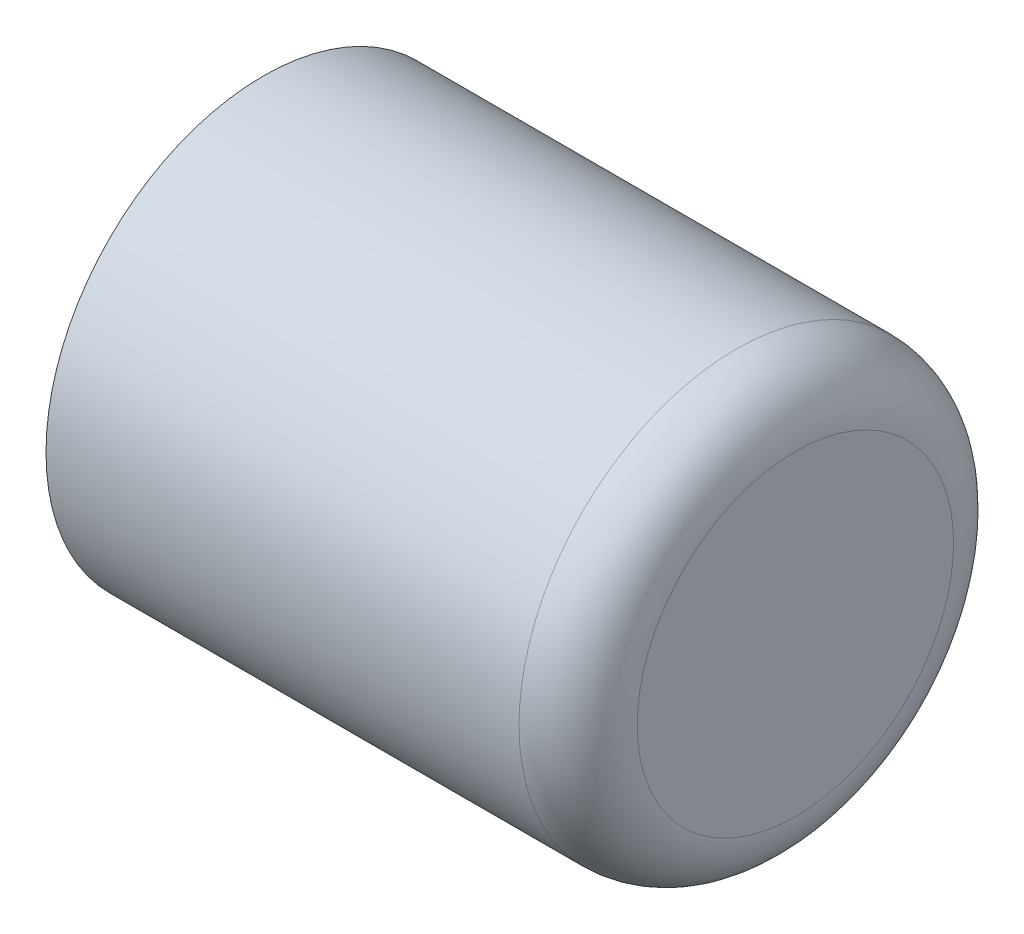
ISO-10303-21;
HEADER;
FILE_DESCRIPTION(('STEP AP214'),'2;1');
FILE_NAME('part.step','',(''),(''),'','','');
FILE_SCHEMA(('AUTOMOTIVE_DESIGN { 1 0 10303 214 1 1 1 1 }'));
ENDSEC;
DATA;
#1=APPLICATION_CONTEXT('core data for automotive mechanical design processes');
#2=APPLICATION_PROTOCOL_DEFINITION('international standard','automotive_design',2000,#1);
#3=PRODUCT_CONTEXT('',#1,'mechanical');
#4=PRODUCT('Part','Part','',(#3));
#5=PRODUCT_RELATED_PRODUCT_CATEGORY('part','',(#4));
#6=PRODUCT_DEFINITION_FORMATION('','',#4);
#7=PRODUCT_DEFINITION_CONTEXT('part definition',#1,'design');
#8=PRODUCT_DEFINITION('design','',#6,#7);
#9=PRODUCT_DEFINITION_SHAPE('','',#8);
#10=(LENGTH_UNIT() NAMED_UNIT(*) SI_UNIT(.MILLI.,.METRE.));
#11=(NAMED_UNIT(*) PLANE_ANGLE_UNIT() SI_UNIT($,.RADIAN.));
#12=(NAMED_UNIT(*) SI_UNIT($,.STERADIAN.) SOLID_ANGLE_UNIT());
#13=UNCERTAINTY_MEASURE_WITH_UNIT(LENGTH_MEASURE(1.E-05),#10,'distance_accuracy_value','');
#14=(GEOMETRIC_REPRESENTATION_CONTEXT(3) GLOBAL_UNCERTAINTY_ASSIGNED_CONTEXT((#13)) GLOBAL_UNIT_ASSIGNED_CONTEXT((#10,
#11,#12)) REPRESENTATION_CONTEXT('',''));
#15=CARTESIAN_POINT('',(0.,0.,0.));
#16=DIRECTION('',(0.,0.,1.));
#17=DIRECTION('',(1.,0.,0.));
#18=AXIS2_PLACEMENT_3D('',#15,#16,#17);
#19=CARTESIAN_POINT('',(0.,0.,0.));
#20=DIRECTION('',(-1.,0.,0.));
#21=DIRECTION('',(0.,0.,1.));
#22=AXIS2_PLACEMENT_3D('',#19,#20,#21);
#23=TOROIDAL_SURFACE('',#22,5.35,2.);
#24=CARTESIAN_POINT('',(0.,0.,0.));
#25=DIRECTION('',(-1.,0.,0.));
#26=DIRECTION('',(0.,0.,1.));
#27=AXIS2_PLACEMENT_3D('',#24,#25,#26);
#28=CIRCLE('',#27,7.35);
#29=CARTESIAN_POINT('',(0.,0.,7.35));
#30=VERTEX_POINT('',#29);
#31=EDGE_CURVE('E54',#30,#30,#28,.T.);
#32=ORIENTED_EDGE('',*,*,#31,.F.);
#33=EDGE_LOOP('',(#32));
#34=FACE_BOUND('',#33,.T.);
#35=CARTESIAN_POINT('',(2.,0.,0.));
#36=DIRECTION('',(-1.,0.,0.));
#37=DIRECTION('',(0.,0.,1.));
#38=AXIS2_PLACEMENT_3D('',#35,#36,#37);
#39=CIRCLE('',#38,5.35);
#40=CARTESIAN_POINT('',(2.,0.,5.35));
#41=VERTEX_POINT('',#40);
#42=EDGE_CURVE('E10',#41,#41,#39,.T.);
#43=ORIENTED_EDGE('',*,*,#42,.T.);
#44=EDGE_LOOP('',(#43));
#45=FACE_BOUND('',#44,.T.);
#46=ADVANCED_FACE('F32',(#34,#45),#23,.T.);
#47=CARTESIAN_POINT('',(2.,5.35,0.));
#48=DIRECTION('',(-1.,0.,0.));
#49=DIRECTION('',(0.,0.,1.));
#50=AXIS2_PLACEMENT_3D('',#47,#48,#49);
#51=PLANE('',#50);
#52=ORIENTED_EDGE('',*,*,#42,.F.);
#53=EDGE_LOOP('',(#52));
#54=FACE_BOUND('',#53,.T.);
#55=ADVANCED_FACE('F61',(#54),#51,.F.);
#56=CARTESIAN_POINT('',(0.799999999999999,5.35,0.));
#57=DIRECTION('',(1.,0.,0.));
#58=DIRECTION('',(0.,0.,-1.));
#59=AXIS2_PLACEMENT_3D('',#56,#57,#58);
#60=PLANE('',#59);
#61=CARTESIAN_POINT('',(0.799999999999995,0.,0.));
#62=DIRECTION('',(-1.,0.,0.));
#63=DIRECTION('',(0.,0.,1.));
#64=AXIS2_PLACEMENT_3D('',#61,#62,#63);
#65=CIRCLE('',#64,5.35);
#66=CARTESIAN_POINT('',(0.799999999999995,0.,5.35));
#67=VERTEX_POINT('',#66);
#68=EDGE_CURVE('E38',#67,#67,#65,.T.);
#69=ORIENTED_EDGE('',*,*,#68,.T.);
#70=EDGE_LOOP('',(#69));
#71=FACE_BOUND('',#70,.T.);
#72=ADVANCED_FACE('F65',(#71),#60,.F.);
#73=CARTESIAN_POINT('',(0.,0.,0.));
#74=DIRECTION('',(-1.,0.,0.));
#75=DIRECTION('',(0.,0.,1.));
#76=AXIS2_PLACEMENT_3D('',#73,#74,#75);
#77=TOROIDAL_SURFACE('',#76,5.35,0.799999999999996);
#78=ORIENTED_EDGE('',*,*,#68,.F.);
#79=EDGE_LOOP('',(#78));
#80=FACE_BOUND('',#79,.T.);
#81=CARTESIAN_POINT('',(0.,0.,0.));
#82=DIRECTION('',(-1.,0.,0.));
#83=DIRECTION('',(0.,0.,1.));
#84=AXIS2_PLACEMENT_3D('',#81,#82,#83);
#85=CIRCLE('',#84,6.15);
#86=CARTESIAN_POINT('',(0.,0.,6.15));
#87=VERTEX_POINT('',#86);
#88=EDGE_CURVE('E42',#87,#87,#85,.T.);
#89=ORIENTED_EDGE('',*,*,#88,.T.);
#90=EDGE_LOOP('',(#89));
#91=FACE_BOUND('',#90,.T.);
#92=ADVANCED_FACE('F70',(#80,#91),#77,.F.);
#93=CARTESIAN_POINT('',(-43.1825143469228,0.,0.));
#94=DIRECTION('',(-1.,0.,0.));
#95=DIRECTION('',(0.,0.,1.));
#96=AXIS2_PLACEMENT_3D('',#93,#94,#95);
#97=CYLINDRICAL_SURFACE('',#96,6.15);
#98=ORIENTED_EDGE('',*,*,#88,.F.);
#99=EDGE_LOOP('',(#98));
#100=FACE_BOUND('',#99,.T.);
#101=CARTESIAN_POINT('',(-16.,0.,0.));
#102=DIRECTION('',(-1.,0.,0.));
#103=DIRECTION('',(0.,0.,1.));
#104=AXIS2_PLACEMENT_3D('',#101,#102,#103);
#105=CIRCLE('',#104,6.15);
#106=CARTESIAN_POINT('',(-16.,0.,6.15));
#107=VERTEX_POINT('',#106);
#108=EDGE_CURVE('E46',#107,#107,#105,.T.);
#109=ORIENTED_EDGE('',*,*,#108,.T.);
#110=EDGE_LOOP('',(#109));
#111=FACE_BOUND('',#110,.T.);
#112=ADVANCED_FACE('F75',(#100,#111),#97,.F.);
#113=CARTESIAN_POINT('',(-16.,7.35,0.));
#114=DIRECTION('',(1.,0.,0.));
#115=DIRECTION('',(0.,0.,-1.));
#116=AXIS2_PLACEMENT_3D('',#113,#114,#115);
#117=PLANE('',#116);
#118=ORIENTED_EDGE('',*,*,#108,.F.);
#119=EDGE_LOOP('',(#118));
#120=FACE_BOUND('',#119,.T.);
#121=CARTESIAN_POINT('',(-16.,0.,0.));
#122=DIRECTION('',(-1.,0.,0.));
#123=DIRECTION('',(0.,0.,1.));
#124=AXIS2_PLACEMENT_3D('',#121,#122,#123);
#125=CIRCLE('',#124,7.35);
#126=CARTESIAN_POINT('',(-16.,0.,7.35));
#127=VERTEX_POINT('',#126);
#128=EDGE_CURVE('E51',#127,#127,#125,.T.);
#129=ORIENTED_EDGE('',*,*,#128,.T.);
#130=EDGE_LOOP('',(#129));
#131=FACE_BOUND('',#130,.T.);
#132=ADVANCED_FACE('F79',(#120,#131),#117,.F.);
#133=CARTESIAN_POINT('',(-43.1825143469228,0.,0.));
#134=DIRECTION('',(-1.,0.,0.));
#135=DIRECTION('',(0.,0.,1.));
#136=AXIS2_PLACEMENT_3D('',#133,#134,#135);
#137=CYLINDRICAL_SURFACE('',#136,7.35);
#138=ORIENTED_EDGE('',*,*,#128,.F.);
#139=EDGE_LOOP('',(#138));
#140=FACE_BOUND('',#139,.T.);
#141=ORIENTED_EDGE('',*,*,#31,.T.);
#142=EDGE_LOOP('',(#141));
#143=FACE_BOUND('',#142,.T.);
#144=ADVANCED_FACE('F58',(#140,#143),#137,.T.);
#145=CLOSED_SHELL('',(#46,#55,#72,#92,#112,#132,#144));
#146=MANIFOLD_SOLID_BREP('B2',#145);
#147=ADVANCED_BREP_SHAPE_REPRESENTATION('',(#18,#146),#14);
#148=SHAPE_DEFINITION_REPRESENTATION(#9,#147);
ENDSEC;
END-ISO-10303-21;
